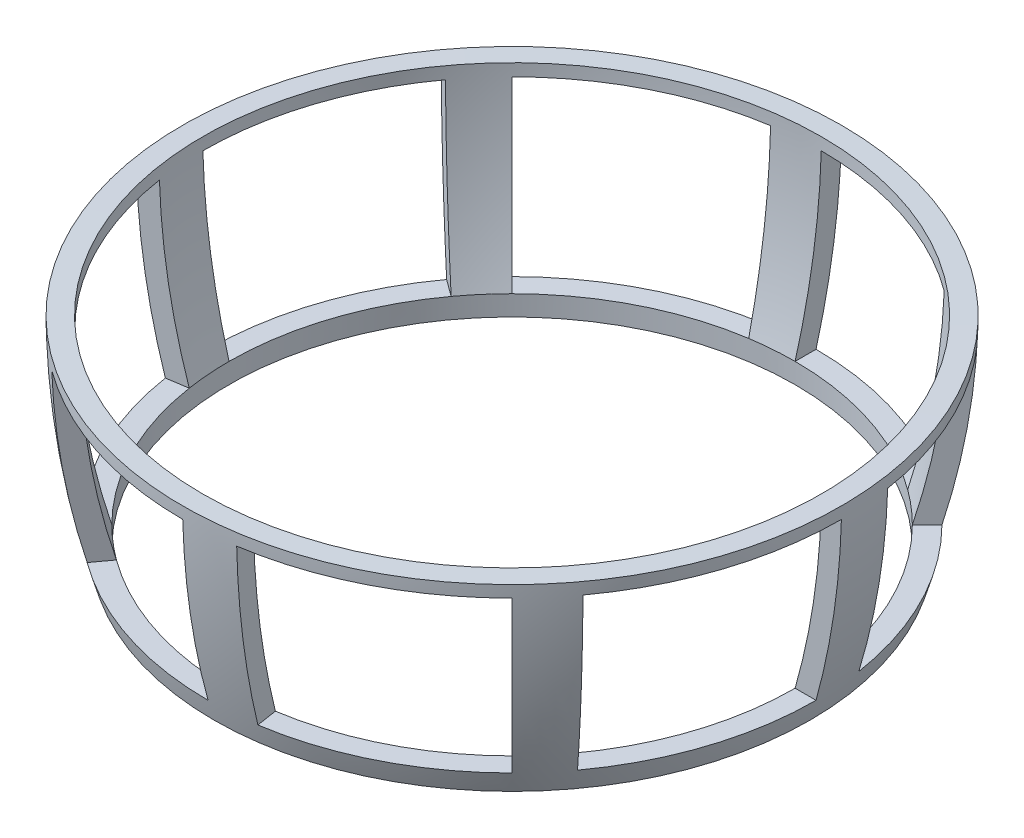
ISO-10303-21;
HEADER;
FILE_DESCRIPTION(('STEP AP214'),'2;1');
FILE_NAME('part.step','',(''),(''),'','','');
FILE_SCHEMA(('AUTOMOTIVE_DESIGN { 1 0 10303 214 1 1 1 1 }'));
ENDSEC;
DATA;
#1=APPLICATION_CONTEXT('core data for automotive mechanical design processes');
#2=APPLICATION_PROTOCOL_DEFINITION('international standard','automotive_design',2000,#1);
#3=PRODUCT_CONTEXT('',#1,'mechanical');
#4=PRODUCT('Part','Part','',(#3));
#5=PRODUCT_RELATED_PRODUCT_CATEGORY('part','',(#4));
#6=PRODUCT_DEFINITION_FORMATION('','',#4);
#7=PRODUCT_DEFINITION_CONTEXT('part definition',#1,'design');
#8=PRODUCT_DEFINITION('design','',#6,#7);
#9=PRODUCT_DEFINITION_SHAPE('','',#8);
#10=(LENGTH_UNIT() NAMED_UNIT(*) SI_UNIT(.MILLI.,.METRE.));
#11=(NAMED_UNIT(*) PLANE_ANGLE_UNIT() SI_UNIT($,.RADIAN.));
#12=(NAMED_UNIT(*) SI_UNIT($,.STERADIAN.) SOLID_ANGLE_UNIT());
#13=UNCERTAINTY_MEASURE_WITH_UNIT(LENGTH_MEASURE(1.E-05),#10,'distance_accuracy_value','');
#14=(GEOMETRIC_REPRESENTATION_CONTEXT(3) GLOBAL_UNCERTAINTY_ASSIGNED_CONTEXT((#13)) GLOBAL_UNIT_ASSIGNED_CONTEXT((#10,
#11,#12)) REPRESENTATION_CONTEXT('',''));
#15=CARTESIAN_POINT('',(0.,0.,0.));
#16=DIRECTION('',(0.,0.,1.));
#17=DIRECTION('',(1.,0.,0.));
#18=AXIS2_PLACEMENT_3D('',#15,#16,#17);
#19=CARTESIAN_POINT('',(0.,0.,0.));
#20=DIRECTION('',(0.,-1.,0.));
#21=DIRECTION('',(0.,0.,-1.));
#22=AXIS2_PLACEMENT_3D('',#19,#20,#21);
#23=PLANE('',#22);
#24=DIRECTION('',(0.,0.,-1.));
#25=VECTOR('',#24,1.);
#26=CARTESIAN_POINT('',(-9.82368815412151E-13,0.,93.7872037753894));
#27=LINE('',#26,#25);
#28=CARTESIAN_POINT('',(7.32613969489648E-13,0.,-70.2));
#29=VERTEX_POINT('',#28);
#30=CARTESIAN_POINT('',(7.7715611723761E-13,0.,-75.3937068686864));
#31=VERTEX_POINT('',#30);
#32=EDGE_CURVE('E558',#29,#31,#27,.T.);
#33=ORIENTED_EDGE('',*,*,#32,.F.);
#34=CARTESIAN_POINT('',(0.,0.,0.));
#35=DIRECTION('',(0.,1.,0.));
#36=DIRECTION('',(0.,0.,1.));
#37=AXIS2_PLACEMENT_3D('',#34,#35,#36);
#38=CIRCLE('',#37,70.2);
#39=CARTESIAN_POINT('',(41.5050402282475,0.,-56.6160015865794));
#40=VERTEX_POINT('',#39);
#41=EDGE_CURVE('E693',#40,#29,#38,.T.);
#42=ORIENTED_EDGE('',*,*,#41,.F.);
#43=DIRECTION('',(-0.591239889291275,0.,0.806495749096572));
#44=VECTOR('',#43,1.);
#45=CARTESIAN_POINT('',(0.,0.,0.));
#46=LINE('',#45,#44);
#47=CARTESIAN_POINT('',(44.575766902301,0.,-60.8047040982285));
#48=VERTEX_POINT('',#47);
#49=EDGE_CURVE('E494',#48,#40,#46,.T.);
#50=ORIENTED_EDGE('',*,*,#49,.F.);
#51=CARTESIAN_POINT('',(0.,0.,0.));
#52=DIRECTION('',(0.,1.,0.));
#53=DIRECTION('',(0.707106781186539,0.,0.707106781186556));
#54=AXIS2_PLACEMENT_3D('',#51,#52,#53);
#55=CIRCLE('',#54,75.3937068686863);
#56=EDGE_CURVE('E508',#31,#48,#55,.F.);
#57=ORIENTED_EDGE('',*,*,#56,.F.);
#58=EDGE_LOOP('',(#33,#42,#50,#57));
#59=FACE_BOUND('',#58,.T.);
#60=ADVANCED_FACE('F40',(#59),#23,.F.);
#61=DIRECTION('',(0.707106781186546,0.,-0.707106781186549));
#62=VECTOR('',#61,1.);
#63=CARTESIAN_POINT('',(0.,0.,0.));
#64=LINE('',#63,#62);
#65=CARTESIAN_POINT('',(49.6388960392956,0.,-49.6388960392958));
#66=VERTEX_POINT('',#65);
#67=CARTESIAN_POINT('',(53.3114013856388,0.,-53.311401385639));
#68=VERTEX_POINT('',#67);
#69=EDGE_CURVE('E322',#66,#68,#64,.T.);
#70=ORIENTED_EDGE('',*,*,#69,.F.);
#71=CARTESIAN_POINT('',(69.3820540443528,0.,-10.6850632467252));
#72=VERTEX_POINT('',#71);
#73=EDGE_CURVE('E685',#72,#66,#38,.T.);
#74=ORIENTED_EDGE('',*,*,#73,.F.);
#75=DIRECTION('',(-0.988348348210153,0.,0.152208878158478));
#76=VECTOR('',#75,1.);
#77=CARTESIAN_POINT('',(0.,0.,0.));
#78=LINE('',#77,#76);
#79=CARTESIAN_POINT('',(74.5152456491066,0.,-11.4755915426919));
#80=VERTEX_POINT('',#79);
#81=EDGE_CURVE('E325',#80,#72,#78,.T.);
#82=ORIENTED_EDGE('',*,*,#81,.F.);
#83=CARTESIAN_POINT('',(0.,0.,0.));
#84=DIRECTION('',(0.,1.,0.));
#85=DIRECTION('',(0.,0.,1.));
#86=AXIS2_PLACEMENT_3D('',#83,#84,#85);
#87=CIRCLE('',#86,75.3937068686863);
#88=EDGE_CURVE('E336',#68,#80,#87,.F.);
#89=ORIENTED_EDGE('',*,*,#88,.F.);
#90=EDGE_LOOP('',(#70,#74,#82,#89));
#91=FACE_BOUND('',#90,.T.);
#92=ADVANCED_FACE('F380',(#91),#23,.F.);
#93=DIRECTION('',(1.,0.,0.));
#94=VECTOR('',#93,1.);
#95=CARTESIAN_POINT('',(-93.7872037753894,0.,0.));
#96=LINE('',#95,#94);
#97=CARTESIAN_POINT('',(70.2,0.,0.));
#98=VERTEX_POINT('',#97);
#99=CARTESIAN_POINT('',(75.3937068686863,0.,0.));
#100=VERTEX_POINT('',#99);
#101=EDGE_CURVE('E12',#98,#100,#96,.T.);
#102=ORIENTED_EDGE('',*,*,#101,.F.);
#103=CARTESIAN_POINT('',(56.6160015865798,0.,41.505040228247));
#104=VERTEX_POINT('',#103);
#105=EDGE_CURVE('E499',#104,#98,#38,.T.);
#106=ORIENTED_EDGE('',*,*,#105,.F.);
#107=DIRECTION('',(-0.806495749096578,0.,-0.591239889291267));
#108=VECTOR('',#107,1.);
#109=CARTESIAN_POINT('',(0.,0.,0.));
#110=LINE('',#109,#108);
#111=CARTESIAN_POINT('',(60.804704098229,0.,44.5757669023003));
#112=VERTEX_POINT('',#111);
#113=EDGE_CURVE('E272',#112,#104,#110,.T.);
#114=ORIENTED_EDGE('',*,*,#113,.F.);
#115=CARTESIAN_POINT('',(0.,0.,0.));
#116=DIRECTION('',(0.,1.,0.));
#117=DIRECTION('',(-0.707106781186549,0.,0.707106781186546));
#118=AXIS2_PLACEMENT_3D('',#115,#116,#117);
#119=CIRCLE('',#118,75.3937068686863);
#120=EDGE_CURVE('E302',#100,#112,#119,.F.);
#121=ORIENTED_EDGE('',*,*,#120,.F.);
#122=EDGE_LOOP('',(#102,#106,#114,#121));
#123=FACE_BOUND('',#122,.T.);
#124=ADVANCED_FACE('F385',(#123),#23,.F.);
#125=DIRECTION('',(0.707106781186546,0.,0.707106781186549));
#126=VECTOR('',#125,1.);
#127=CARTESIAN_POINT('',(-66.3175677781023,0.,-66.3175677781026));
#128=LINE('',#127,#126);
#129=CARTESIAN_POINT('',(49.6388960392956,0.,49.6388960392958));
#130=VERTEX_POINT('',#129);
#131=CARTESIAN_POINT('',(53.3114013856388,0.,53.311401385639));
#132=VERTEX_POINT('',#131);
#133=EDGE_CURVE('E319',#130,#132,#128,.T.);
#134=ORIENTED_EDGE('',*,*,#133,.F.);
#135=CARTESIAN_POINT('',(10.6850632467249,0.,69.3820540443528));
#136=VERTEX_POINT('',#135);
#137=EDGE_CURVE('E262',#136,#130,#38,.T.);
#138=ORIENTED_EDGE('',*,*,#137,.F.);
#139=DIRECTION('',(-0.152208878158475,0.,-0.988348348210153));
#140=VECTOR('',#139,1.);
#141=CARTESIAN_POINT('',(0.,0.,0.));
#142=LINE('',#141,#140);
#143=CARTESIAN_POINT('',(11.4755915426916,0.,74.5152456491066));
#144=VERTEX_POINT('',#143);
#145=EDGE_CURVE('E654',#144,#136,#142,.T.);
#146=ORIENTED_EDGE('',*,*,#145,.F.);
#147=CARTESIAN_POINT('',(0.,0.,0.));
#148=DIRECTION('',(0.,1.,0.));
#149=DIRECTION('',(-1.,0.,0.));
#150=AXIS2_PLACEMENT_3D('',#147,#148,#149);
#151=CIRCLE('',#150,75.3937068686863);
#152=EDGE_CURVE('E663',#132,#144,#151,.F.);
#153=ORIENTED_EDGE('',*,*,#152,.F.);
#154=EDGE_LOOP('',(#134,#138,#146,#153));
#155=FACE_BOUND('',#154,.T.);
#156=ADVANCED_FACE('F679',(#155),#23,.F.);
#157=DIRECTION('',(0.,0.,1.));
#158=VECTOR('',#157,1.);
#159=CARTESIAN_POINT('',(3.27456271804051E-13,0.,-93.7872037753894));
#160=LINE('',#159,#158);
#161=CARTESIAN_POINT('',(-2.54590792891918E-13,0.,70.2));
#162=VERTEX_POINT('',#161);
#163=CARTESIAN_POINT('',(-2.63677968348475E-13,0.,75.3937068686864));
#164=VERTEX_POINT('',#163);
#165=EDGE_CURVE('E264',#162,#164,#160,.T.);
#166=ORIENTED_EDGE('',*,*,#165,.F.);
#167=CARTESIAN_POINT('',(-41.5050402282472,0.,56.6160015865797));
#168=VERTEX_POINT('',#167);
#169=EDGE_CURVE('E249',#168,#162,#38,.T.);
#170=ORIENTED_EDGE('',*,*,#169,.F.);
#171=DIRECTION('',(0.59123988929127,0.,-0.806495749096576));
#172=VECTOR('',#171,1.);
#173=CARTESIAN_POINT('',(0.,0.,0.));
#174=LINE('',#173,#172);
#175=CARTESIAN_POINT('',(-44.5757669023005,0.,60.8047040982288));
#176=VERTEX_POINT('',#175);
#177=EDGE_CURVE('E629',#176,#168,#174,.T.);
#178=ORIENTED_EDGE('',*,*,#177,.F.);
#179=CARTESIAN_POINT('',(0.,0.,0.));
#180=DIRECTION('',(0.,1.,0.));
#181=DIRECTION('',(-0.707106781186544,0.,-0.707106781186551));
#182=AXIS2_PLACEMENT_3D('',#179,#180,#181);
#183=CIRCLE('',#182,75.3937068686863);
#184=EDGE_CURVE('E267',#164,#176,#183,.F.);
#185=ORIENTED_EDGE('',*,*,#184,.F.);
#186=EDGE_LOOP('',(#166,#170,#178,#185));
#187=FACE_BOUND('',#186,.T.);
#188=ADVANCED_FACE('F265',(#187),#23,.F.);
#189=DIRECTION('',(-0.707106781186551,0.,0.707106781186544));
#190=VECTOR('',#189,1.);
#191=CARTESIAN_POINT('',(66.3175677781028,0.,-66.3175677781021));
#192=LINE('',#191,#190);
#193=CARTESIAN_POINT('',(-49.6388960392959,0.,49.6388960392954));
#194=VERTEX_POINT('',#193);
#195=CARTESIAN_POINT('',(-53.3114013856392,0.,53.3114013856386));
#196=VERTEX_POINT('',#195);
#197=EDGE_CURVE('E652',#194,#196,#192,.T.);
#198=ORIENTED_EDGE('',*,*,#197,.F.);
#199=CARTESIAN_POINT('',(-69.3820540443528,0.,10.6850632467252));
#200=VERTEX_POINT('',#199);
#201=EDGE_CURVE('E260',#200,#194,#38,.T.);
#202=ORIENTED_EDGE('',*,*,#201,.F.);
#203=DIRECTION('',(0.988348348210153,0.,-0.152208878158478));
#204=VECTOR('',#203,1.);
#205=CARTESIAN_POINT('',(0.,0.,0.));
#206=LINE('',#205,#204);
#207=CARTESIAN_POINT('',(-74.5152456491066,0.,11.4755915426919));
#208=VERTEX_POINT('',#207);
#209=EDGE_CURVE('E595',#208,#200,#206,.T.);
#210=ORIENTED_EDGE('',*,*,#209,.F.);
#211=CARTESIAN_POINT('',(0.,0.,0.));
#212=DIRECTION('',(0.,1.,0.));
#213=DIRECTION('',(0.,0.,-1.));
#214=AXIS2_PLACEMENT_3D('',#211,#212,#213);
#215=CIRCLE('',#214,75.3937068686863);
#216=EDGE_CURVE('E606',#196,#208,#215,.F.);
#217=ORIENTED_EDGE('',*,*,#216,.F.);
#218=EDGE_LOOP('',(#198,#202,#210,#217));
#219=FACE_BOUND('',#218,.T.);
#220=ADVANCED_FACE('F732',(#219),#23,.F.);
#221=DIRECTION('',(-1.,0.,0.));
#222=VECTOR('',#221,1.);
#223=CARTESIAN_POINT('',(93.7872037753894,0.,0.));
#224=LINE('',#223,#222);
#225=CARTESIAN_POINT('',(-70.2,0.,-5.02242691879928E-13));
#226=VERTEX_POINT('',#225);
#227=CARTESIAN_POINT('',(-75.3937068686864,0.,-5.13478148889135E-13));
#228=VERTEX_POINT('',#227);
#229=EDGE_CURVE('E626',#226,#228,#224,.T.);
#230=ORIENTED_EDGE('',*,*,#229,.F.);
#231=CARTESIAN_POINT('',(-56.6160015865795,0.,-41.5050402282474));
#232=VERTEX_POINT('',#231);
#233=EDGE_CURVE('E711',#232,#226,#38,.T.);
#234=ORIENTED_EDGE('',*,*,#233,.F.);
#235=DIRECTION('',(0.806495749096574,0.,0.591239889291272));
#236=VECTOR('',#235,1.);
#237=CARTESIAN_POINT('',(0.,0.,0.));
#238=LINE('',#237,#236);
#239=CARTESIAN_POINT('',(-60.8047040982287,0.,-44.5757669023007));
#240=VERTEX_POINT('',#239);
#241=EDGE_CURVE('E561',#240,#232,#238,.T.);
#242=ORIENTED_EDGE('',*,*,#241,.F.);
#243=CARTESIAN_POINT('',(0.,0.,0.));
#244=DIRECTION('',(0.,1.,0.));
#245=DIRECTION('',(0.707106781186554,0.,-0.707106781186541));
#246=AXIS2_PLACEMENT_3D('',#243,#244,#245);
#247=CIRCLE('',#246,75.3937068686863);
#248=EDGE_CURVE('E572',#228,#240,#247,.F.);
#249=ORIENTED_EDGE('',*,*,#248,.F.);
#250=EDGE_LOOP('',(#230,#234,#242,#249));
#251=FACE_BOUND('',#250,.T.);
#252=ADVANCED_FACE('F378',(#251),#23,.F.);
#253=CARTESIAN_POINT('',(-93.7872037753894,46.8115584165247,0.));
#254=DIRECTION('',(0.,0.,1.));
#255=DIRECTION('',(1.,0.,0.));
#256=AXIS2_PLACEMENT_3D('',#253,#254,#255);
#257=PLANE('',#256);
#258=CARTESIAN_POINT('',(-93.7872037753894,46.8115584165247,0.));
#259=DIRECTION('',(0.,0.,1.));
#260=DIRECTION('',(1.,0.,0.));
#261=AXIS2_PLACEMENT_3D('',#258,#259,#260);
#262=CIRCLE('',#261,170.537752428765);
#263=CARTESIAN_POINT('',(76.6826583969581,42.,0.));
#264=VERTEX_POINT('',#263);
#265=EDGE_CURVE('E349',#98,#264,#262,.T.);
#266=ORIENTED_EDGE('',*,*,#265,.F.);
#267=ORIENTED_EDGE('',*,*,#101,.T.);
#268=CARTESIAN_POINT('',(-93.7872037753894,46.8115584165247,0.));
#269=DIRECTION('',(0.,0.,1.));
#270=DIRECTION('',(1.,0.,0.));
#271=AXIS2_PLACEMENT_3D('',#268,#269,#270);
#272=CIRCLE('',#271,175.537752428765);
#273=CARTESIAN_POINT('',(81.6845929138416,42.,0.));
#274=VERTEX_POINT('',#273);
#275=EDGE_CURVE('E347',#100,#274,#272,.T.);
#276=ORIENTED_EDGE('',*,*,#275,.T.);
#277=DIRECTION('',(-1.,0.,0.));
#278=VECTOR('',#277,1.);
#279=CARTESIAN_POINT('',(-93.7872037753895,42.,0.));
#280=LINE('',#279,#278);
#281=EDGE_CURVE('E305',#274,#264,#280,.T.);
#282=ORIENTED_EDGE('',*,*,#281,.T.);
#283=EDGE_LOOP('',(#266,#267,#276,#282));
#284=FACE_BOUND('',#283,.T.);
#285=ADVANCED_FACE('F395',(#284),#257,.T.);
#286=CARTESIAN_POINT('',(0.,46.8115584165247,0.));
#287=DIRECTION('',(0.,-1.,0.));
#288=DIRECTION('',(0.,0.,-1.));
#289=AXIS2_PLACEMENT_3D('',#286,#287,#288);
#290=DEGENERATE_TOROIDAL_SURFACE('',#289,93.7872037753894,175.537752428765,.F.);
#291=CARTESIAN_POINT('',(-66.3175677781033,46.8115584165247,66.3175677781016));
#292=DIRECTION('',(0.707106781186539,0.,0.707106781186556));
#293=DIRECTION('',(0.707106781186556,0.,-0.707106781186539));
#294=AXIS2_PLACEMENT_3D('',#291,#292,#293);
#295=CIRCLE('',#294,175.537752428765);
#296=CARTESIAN_POINT('',(57.7597295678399,42.,-57.7597295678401));
#297=VERTEX_POINT('',#296);
#298=EDGE_CURVE('E519',#68,#297,#295,.T.);
#299=ORIENTED_EDGE('',*,*,#298,.F.);
#300=ORIENTED_EDGE('',*,*,#88,.T.);
#301=CARTESIAN_POINT('',(-92.6944279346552,46.8115584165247,14.2752450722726));
#302=DIRECTION('',(0.152208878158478,0.,0.988348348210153));
#303=DIRECTION('',(0.988348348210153,0.,-0.152208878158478));
#304=AXIS2_PLACEMENT_3D('',#301,#302,#303);
#305=CIRCLE('',#304,175.537752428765);
#306=CARTESIAN_POINT('',(80.732832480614,42.,-12.4331202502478));
#307=VERTEX_POINT('',#306);
#308=EDGE_CURVE('E334',#307,#80,#305,.F.);
#309=ORIENTED_EDGE('',*,*,#308,.F.);
#310=CARTESIAN_POINT('',(0.,42.,0.));
#311=DIRECTION('',(0.,1.,0.));
#312=DIRECTION('',(0.,0.,1.));
#313=AXIS2_PLACEMENT_3D('',#310,#311,#312);
#314=CIRCLE('',#313,81.6845929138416);
#315=EDGE_CURVE('E345',#297,#307,#314,.F.);
#316=ORIENTED_EDGE('',*,*,#315,.F.);
#317=EDGE_LOOP('',(#299,#300,#309,#316));
#318=FACE_BOUND('',#317,.T.);
#319=CARTESIAN_POINT('',(0.,44.9468868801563,0.));
#320=DIRECTION('',(0.,-1.,0.));
#321=DIRECTION('',(0.,0.,-1.));
#322=AXIS2_PLACEMENT_3D('',#319,#320,#321);
#323=CIRCLE('',#322,81.7406445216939);
#324=CARTESIAN_POINT('',(0.,44.9468868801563,-81.7406445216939));
#325=VERTEX_POINT('',#324);
#326=EDGE_CURVE('E48',#325,#325,#323,.T.);
#327=ORIENTED_EDGE('',*,*,#326,.T.);
#328=EDGE_LOOP('',(#327));
#329=FACE_BOUND('',#328,.T.);
#330=ORIENTED_EDGE('',*,*,#275,.F.);
#331=ORIENTED_EDGE('',*,*,#120,.T.);
#332=CARTESIAN_POINT('',(-75.6389811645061,46.8115584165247,-55.4507359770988));
#333=DIRECTION('',(-0.591239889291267,0.,0.806495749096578));
#334=DIRECTION('',(0.806495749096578,0.,0.591239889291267));
#335=AXIS2_PLACEMENT_3D('',#332,#333,#334);
#336=CIRCLE('',#335,175.537752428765);
#337=CARTESIAN_POINT('',(65.8782769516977,42.,48.2951896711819));
#338=VERTEX_POINT('',#337);
#339=EDGE_CURVE('E300',#338,#112,#336,.F.);
#340=ORIENTED_EDGE('',*,*,#339,.F.);
#341=CARTESIAN_POINT('',(0.,42.,0.));
#342=DIRECTION('',(0.,1.,0.));
#343=DIRECTION('',(-0.707106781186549,0.,0.707106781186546));
#344=AXIS2_PLACEMENT_3D('',#341,#342,#343);
#345=CIRCLE('',#344,81.6845929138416);
#346=EDGE_CURVE('E308',#274,#338,#345,.F.);
#347=ORIENTED_EDGE('',*,*,#346,.F.);
#348=EDGE_LOOP('',(#330,#331,#340,#347));
#349=FACE_BOUND('',#348,.T.);
#350=CARTESIAN_POINT('',(0.,-5.,0.));
#351=DIRECTION('',(0.,-1.,0.));
#352=DIRECTION('',(0.,0.,-1.));
#353=AXIS2_PLACEMENT_3D('',#350,#351,#352);
#354=CIRCLE('',#353,73.9300134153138);
#355=CARTESIAN_POINT('',(0.,-5.,-73.9300134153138));
#356=VERTEX_POINT('',#355);
#357=EDGE_CURVE('E352',#356,#356,#354,.T.);
#358=ORIENTED_EDGE('',*,*,#357,.F.);
#359=EDGE_LOOP('',(#358));
#360=FACE_BOUND('',#359,.T.);
#361=CARTESIAN_POINT('',(-66.3175677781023,46.8115584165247,-66.3175677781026));
#362=DIRECTION('',(-0.707106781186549,0.,0.707106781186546));
#363=DIRECTION('',(0.707106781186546,0.,0.707106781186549));
#364=AXIS2_PLACEMENT_3D('',#361,#362,#363);
#365=CIRCLE('',#364,175.537752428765);
#366=CARTESIAN_POINT('',(57.7597295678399,42.,57.7597295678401));
#367=VERTEX_POINT('',#366);
#368=EDGE_CURVE('E310',#132,#367,#365,.T.);
#369=ORIENTED_EDGE('',*,*,#368,.F.);
#370=ORIENTED_EDGE('',*,*,#152,.T.);
#371=CARTESIAN_POINT('',(-14.2752450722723,46.8115584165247,-92.6944279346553));
#372=DIRECTION('',(-0.988348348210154,0.,0.152208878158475));
#373=DIRECTION('',(0.152208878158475,0.,0.988348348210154));
#374=AXIS2_PLACEMENT_3D('',#371,#372,#373);
#375=CIRCLE('',#374,175.537752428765);
#376=CARTESIAN_POINT('',(12.4331202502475,42.,80.7328324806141));
#377=VERTEX_POINT('',#376);
#378=EDGE_CURVE('E661',#377,#144,#375,.F.);
#379=ORIENTED_EDGE('',*,*,#378,.F.);
#380=CARTESIAN_POINT('',(0.,42.,0.));
#381=DIRECTION('',(0.,1.,0.));
#382=DIRECTION('',(-1.,0.,0.));
#383=AXIS2_PLACEMENT_3D('',#380,#381,#382);
#384=CIRCLE('',#383,81.6845929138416);
#385=EDGE_CURVE('E289',#367,#377,#384,.F.);
#386=ORIENTED_EDGE('',*,*,#385,.F.);
#387=EDGE_LOOP('',(#369,#370,#379,#386));
#388=FACE_BOUND('',#387,.T.);
#389=CARTESIAN_POINT('',(3.27456271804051E-13,46.8115584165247,-93.7872037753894));
#390=DIRECTION('',(-1.,0.,0.));
#391=DIRECTION('',(0.,0.,1.));
#392=AXIS2_PLACEMENT_3D('',#389,#390,#391);
#393=CIRCLE('',#392,175.537752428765);
#394=CARTESIAN_POINT('',(-2.84494650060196E-13,42.,81.6845929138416));
#395=VERTEX_POINT('',#394);
#396=EDGE_CURVE('E287',#164,#395,#393,.T.);
#397=ORIENTED_EDGE('',*,*,#396,.F.);
#398=ORIENTED_EDGE('',*,*,#184,.T.);
#399=CARTESIAN_POINT('',(55.450735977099,46.8115584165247,-75.6389811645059));
#400=DIRECTION('',(-0.806495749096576,0.,-0.59123988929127));
#401=DIRECTION('',(-0.59123988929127,0.,0.806495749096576));
#402=AXIS2_PLACEMENT_3D('',#399,#400,#401);
#403=CIRCLE('',#402,175.537752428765);
#404=CARTESIAN_POINT('',(-48.2951896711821,42.,65.8782769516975));
#405=VERTEX_POINT('',#404);
#406=EDGE_CURVE('E637',#405,#176,#403,.F.);
#407=ORIENTED_EDGE('',*,*,#406,.F.);
#408=CARTESIAN_POINT('',(0.,42.,0.));
#409=DIRECTION('',(0.,1.,0.));
#410=DIRECTION('',(-0.707106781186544,0.,-0.707106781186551));
#411=AXIS2_PLACEMENT_3D('',#408,#409,#410);
#412=CIRCLE('',#411,81.6845929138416);
#413=EDGE_CURVE('E643',#395,#405,#412,.F.);
#414=ORIENTED_EDGE('',*,*,#413,.F.);
#415=EDGE_LOOP('',(#397,#398,#407,#414));
#416=FACE_BOUND('',#415,.T.);
#417=CARTESIAN_POINT('',(66.3175677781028,46.8115584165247,-66.3175677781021));
#418=DIRECTION('',(-0.707106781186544,0.,-0.707106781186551));
#419=DIRECTION('',(-0.707106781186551,0.,0.707106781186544));
#420=AXIS2_PLACEMENT_3D('',#417,#418,#419);
#421=CIRCLE('',#420,175.537752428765);
#422=CARTESIAN_POINT('',(-57.7597295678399,42.,57.7597295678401));
#423=VERTEX_POINT('',#422);
#424=EDGE_CURVE('E645',#196,#423,#421,.T.);
#425=ORIENTED_EDGE('',*,*,#424,.F.);
#426=ORIENTED_EDGE('',*,*,#216,.T.);
#427=CARTESIAN_POINT('',(92.6944279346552,46.8115584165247,-14.2752450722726));
#428=DIRECTION('',(-0.152208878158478,0.,-0.988348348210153));
#429=DIRECTION('',(-0.988348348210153,0.,0.152208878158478));
#430=AXIS2_PLACEMENT_3D('',#427,#428,#429);
#431=CIRCLE('',#430,175.537752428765);
#432=CARTESIAN_POINT('',(-80.732832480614,42.,12.4331202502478));
#433=VERTEX_POINT('',#432);
#434=EDGE_CURVE('E604',#433,#208,#431,.F.);
#435=ORIENTED_EDGE('',*,*,#434,.F.);
#436=CARTESIAN_POINT('',(0.,42.,0.));
#437=DIRECTION('',(0.,1.,0.));
#438=DIRECTION('',(0.,0.,-1.));
#439=AXIS2_PLACEMENT_3D('',#436,#437,#438);
#440=CIRCLE('',#439,81.6845929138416);
#441=EDGE_CURVE('E615',#423,#433,#440,.F.);
#442=ORIENTED_EDGE('',*,*,#441,.F.);
#443=EDGE_LOOP('',(#425,#426,#435,#442));
#444=FACE_BOUND('',#443,.T.);
#445=CARTESIAN_POINT('',(93.7872037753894,46.8115584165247,0.));
#446=DIRECTION('',(0.,0.,-1.));
#447=DIRECTION('',(-1.,0.,0.));
#448=AXIS2_PLACEMENT_3D('',#445,#446,#447);
#449=CIRCLE('',#448,175.537752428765);
#450=CARTESIAN_POINT('',(-81.6845929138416,42.,-5.62050406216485E-13));
#451=VERTEX_POINT('',#450);
#452=EDGE_CURVE('E617',#228,#451,#449,.T.);
#453=ORIENTED_EDGE('',*,*,#452,.F.);
#454=ORIENTED_EDGE('',*,*,#248,.T.);
#455=CARTESIAN_POINT('',(75.6389811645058,46.8115584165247,55.4507359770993));
#456=DIRECTION('',(0.591239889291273,0.,-0.806495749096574));
#457=DIRECTION('',(-0.806495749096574,0.,-0.591239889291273));
#458=AXIS2_PLACEMENT_3D('',#455,#456,#457);
#459=CIRCLE('',#458,175.537752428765);
#460=CARTESIAN_POINT('',(-65.8782769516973,42.,-48.2951896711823));
#461=VERTEX_POINT('',#460);
#462=EDGE_CURVE('E570',#461,#240,#459,.F.);
#463=ORIENTED_EDGE('',*,*,#462,.F.);
#464=CARTESIAN_POINT('',(0.,42.,0.));
#465=DIRECTION('',(0.,1.,0.));
#466=DIRECTION('',(0.707106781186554,0.,-0.707106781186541));
#467=AXIS2_PLACEMENT_3D('',#464,#465,#466);
#468=CIRCLE('',#467,81.6845929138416);
#469=EDGE_CURVE('E581',#451,#461,#468,.F.);
#470=ORIENTED_EDGE('',*,*,#469,.F.);
#471=EDGE_LOOP('',(#453,#454,#463,#470));
#472=FACE_BOUND('',#471,.T.);
#473=CARTESIAN_POINT('',(66.3175677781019,46.8115584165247,66.317567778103));
#474=DIRECTION('',(0.707106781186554,0.,-0.707106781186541));
#475=DIRECTION('',(-0.707106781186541,0.,-0.707106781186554));
#476=AXIS2_PLACEMENT_3D('',#473,#474,#475);
#477=CIRCLE('',#476,175.537752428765);
#478=CARTESIAN_POINT('',(-53.3114013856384,0.,-53.3114013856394));
#479=VERTEX_POINT('',#478);
#480=CARTESIAN_POINT('',(-57.7597295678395,42.,-57.7597295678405));
#481=VERTEX_POINT('',#480);
#482=EDGE_CURVE('E583',#479,#481,#477,.T.);
#483=ORIENTED_EDGE('',*,*,#482,.F.);
#484=CARTESIAN_POINT('',(0.,0.,0.));
#485=DIRECTION('',(0.,1.,0.));
#486=DIRECTION('',(1.,0.,0.));
#487=AXIS2_PLACEMENT_3D('',#484,#485,#486);
#488=CIRCLE('',#487,75.3937068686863);
#489=CARTESIAN_POINT('',(-11.4755915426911,0.,-74.5152456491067));
#490=VERTEX_POINT('',#489);
#491=EDGE_CURVE('E538',#479,#490,#488,.F.);
#492=ORIENTED_EDGE('',*,*,#491,.T.);
#493=CARTESIAN_POINT('',(14.2752450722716,46.8115584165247,92.6944279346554));
#494=DIRECTION('',(0.988348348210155,0.,-0.152208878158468));
#495=DIRECTION('',(-0.152208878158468,0.,-0.988348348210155));
#496=AXIS2_PLACEMENT_3D('',#493,#494,#495);
#497=CIRCLE('',#496,175.537752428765);
#498=CARTESIAN_POINT('',(-12.4331202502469,42.,-80.7328324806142));
#499=VERTEX_POINT('',#498);
#500=EDGE_CURVE('E536',#499,#490,#497,.F.);
#501=ORIENTED_EDGE('',*,*,#500,.F.);
#502=CARTESIAN_POINT('',(0.,42.,0.));
#503=DIRECTION('',(0.,1.,0.));
#504=DIRECTION('',(1.,0.,0.));
#505=AXIS2_PLACEMENT_3D('',#502,#503,#504);
#506=CIRCLE('',#505,81.6845929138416);
#507=EDGE_CURVE('E547',#481,#499,#506,.F.);
#508=ORIENTED_EDGE('',*,*,#507,.F.);
#509=EDGE_LOOP('',(#483,#492,#501,#508));
#510=FACE_BOUND('',#509,.T.);
#511=CARTESIAN_POINT('',(-9.82368815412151E-13,46.8115584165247,93.7872037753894));
#512=DIRECTION('',(1.,0.,0.));
#513=DIRECTION('',(0.,0.,-1.));
#514=AXIS2_PLACEMENT_3D('',#511,#512,#513);
#515=CIRCLE('',#514,175.537752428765);
#516=CARTESIAN_POINT('',(8.46545056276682E-13,42.,-81.6845929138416));
#517=VERTEX_POINT('',#516);
#518=EDGE_CURVE('E549',#31,#517,#515,.T.);
#519=ORIENTED_EDGE('',*,*,#518,.F.);
#520=ORIENTED_EDGE('',*,*,#56,.T.);
#521=CARTESIAN_POINT('',(-55.4507359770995,46.8115584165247,75.6389811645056));
#522=DIRECTION('',(0.806495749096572,0.,0.591239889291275));
#523=DIRECTION('',(0.591239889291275,0.,-0.806495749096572));
#524=AXIS2_PLACEMENT_3D('',#521,#522,#523);
#525=CIRCLE('',#524,175.537752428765);
#526=CARTESIAN_POINT('',(48.2951896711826,42.,-65.8782769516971));
#527=VERTEX_POINT('',#526);
#528=EDGE_CURVE('E506',#527,#48,#525,.F.);
#529=ORIENTED_EDGE('',*,*,#528,.F.);
#530=CARTESIAN_POINT('',(0.,42.,0.));
#531=DIRECTION('',(0.,1.,0.));
#532=DIRECTION('',(0.707106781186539,0.,0.707106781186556));
#533=AXIS2_PLACEMENT_3D('',#530,#531,#532);
#534=CIRCLE('',#533,81.6845929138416);
#535=EDGE_CURVE('E517',#517,#527,#534,.F.);
#536=ORIENTED_EDGE('',*,*,#535,.F.);
#537=EDGE_LOOP('',(#519,#520,#529,#536));
#538=FACE_BOUND('',#537,.T.);
#539=ADVANCED_FACE('F363',(#318,#329,#349,#360,#388,#416,#444,#472,#510,#538),#290,.F.);
#540=CARTESIAN_POINT('',(0.,45.,0.));
#541=DIRECTION('',(0.,-1.,0.));
#542=DIRECTION('',(0.,0.,-1.));
#543=AXIS2_PLACEMENT_3D('',#540,#541,#542);
#544=CONICAL_SURFACE('',#543,76.7409266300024,1.56017350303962);
#545=ORIENTED_EDGE('',*,*,#326,.F.);
#546=EDGE_LOOP('',(#545));
#547=FACE_BOUND('',#546,.T.);
#548=CARTESIAN_POINT('',(0.,45.,0.));
#549=DIRECTION('',(0.,-1.,0.));
#550=DIRECTION('',(0.,0.,-1.));
#551=AXIS2_PLACEMENT_3D('',#548,#549,#550);
#552=CIRCLE('',#551,76.7409266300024);
#553=CARTESIAN_POINT('',(0.,45.,-76.7409266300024));
#554=VERTEX_POINT('',#553);
#555=EDGE_CURVE('E358',#554,#554,#552,.T.);
#556=ORIENTED_EDGE('',*,*,#555,.T.);
#557=EDGE_LOOP('',(#556));
#558=FACE_BOUND('',#557,.T.);
#559=ADVANCED_FACE('F42',(#547,#558),#544,.T.);
#560=CARTESIAN_POINT('',(0.,46.8115584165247,0.));
#561=DIRECTION('',(0.,-1.,0.));
#562=DIRECTION('',(0.,0.,-1.));
#563=AXIS2_PLACEMENT_3D('',#560,#561,#562);
#564=DEGENERATE_TOROIDAL_SURFACE('',#563,93.7872037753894,170.537752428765,.F.);
#565=ORIENTED_EDGE('',*,*,#555,.F.);
#566=EDGE_LOOP('',(#565));
#567=FACE_BOUND('',#566,.T.);
#568=CARTESIAN_POINT('',(-66.3175677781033,46.8115584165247,66.3175677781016));
#569=DIRECTION('',(0.707106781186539,0.,0.707106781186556));
#570=DIRECTION('',(0.707106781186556,0.,-0.707106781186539));
#571=AXIS2_PLACEMENT_3D('',#568,#569,#570);
#572=CIRCLE('',#571,170.537752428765);
#573=CARTESIAN_POINT('',(54.2228277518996,42.,-54.2228277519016));
#574=VERTEX_POINT('',#573);
#575=EDGE_CURVE('E522',#66,#574,#572,.T.);
#576=ORIENTED_EDGE('',*,*,#575,.T.);
#577=CARTESIAN_POINT('',(0.,42.,0.));
#578=DIRECTION('',(0.,1.,0.));
#579=DIRECTION('',(0.,0.,1.));
#580=AXIS2_PLACEMENT_3D('',#577,#578,#579);
#581=CIRCLE('',#580,76.6826583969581);
#582=CARTESIAN_POINT('',(75.7891787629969,42.,-11.6717814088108));
#583=VERTEX_POINT('',#582);
#584=EDGE_CURVE('E342',#574,#583,#581,.F.);
#585=ORIENTED_EDGE('',*,*,#584,.T.);
#586=CARTESIAN_POINT('',(-92.6944279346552,46.8115584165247,14.2752450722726));
#587=DIRECTION('',(0.152208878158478,0.,0.988348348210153));
#588=DIRECTION('',(0.988348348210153,0.,-0.152208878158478));
#589=AXIS2_PLACEMENT_3D('',#586,#587,#588);
#590=CIRCLE('',#589,170.537752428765);
#591=EDGE_CURVE('E329',#583,#72,#590,.F.);
#592=ORIENTED_EDGE('',*,*,#591,.T.);
#593=CARTESIAN_POINT('',(0.,0.,0.));
#594=DIRECTION('',(0.,-1.,0.));
#595=DIRECTION('',(0.,0.,-1.));
#596=AXIS2_PLACEMENT_3D('',#593,#594,#595);
#597=CIRCLE('',#596,70.2);
#598=EDGE_CURVE('E355',#72,#98,#597,.T.);
#599=ORIENTED_EDGE('',*,*,#598,.T.);
#600=ORIENTED_EDGE('',*,*,#265,.T.);
#601=CARTESIAN_POINT('',(0.,42.,0.));
#602=DIRECTION('',(0.,1.,0.));
#603=DIRECTION('',(-0.707106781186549,0.,0.707106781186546));
#604=AXIS2_PLACEMENT_3D('',#601,#602,#603);
#605=CIRCLE('',#604,76.6826583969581);
#606=CARTESIAN_POINT('',(61.8442380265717,42.,45.3378464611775));
#607=VERTEX_POINT('',#606);
#608=EDGE_CURVE('E61',#264,#607,#605,.F.);
#609=ORIENTED_EDGE('',*,*,#608,.T.);
#610=CARTESIAN_POINT('',(-75.6389811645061,46.8115584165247,-55.4507359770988));
#611=DIRECTION('',(-0.591239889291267,0.,0.806495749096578));
#612=DIRECTION('',(0.806495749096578,0.,0.591239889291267));
#613=AXIS2_PLACEMENT_3D('',#610,#611,#612);
#614=CIRCLE('',#613,170.537752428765);
#615=EDGE_CURVE('E295',#607,#104,#614,.F.);
#616=ORIENTED_EDGE('',*,*,#615,.T.);
#617=CARTESIAN_POINT('',(0.,0.,0.));
#618=DIRECTION('',(0.,-1.,0.));
#619=DIRECTION('',(0.707106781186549,0.,-0.707106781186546));
#620=AXIS2_PLACEMENT_3D('',#617,#618,#619);
#621=CIRCLE('',#620,70.2);
#622=EDGE_CURVE('E316',#104,#130,#621,.T.);
#623=ORIENTED_EDGE('',*,*,#622,.T.);
#624=CARTESIAN_POINT('',(-66.3175677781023,46.8115584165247,-66.3175677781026));
#625=DIRECTION('',(-0.707106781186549,0.,0.707106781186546));
#626=DIRECTION('',(0.707106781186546,0.,0.707106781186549));
#627=AXIS2_PLACEMENT_3D('',#624,#625,#626);
#628=CIRCLE('',#627,170.537752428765);
#629=CARTESIAN_POINT('',(54.2228277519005,42.,54.2228277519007));
#630=VERTEX_POINT('',#629);
#631=EDGE_CURVE('E313',#130,#630,#628,.T.);
#632=ORIENTED_EDGE('',*,*,#631,.T.);
#633=CARTESIAN_POINT('',(0.,42.,0.));
#634=DIRECTION('',(0.,1.,0.));
#635=DIRECTION('',(-1.,0.,0.));
#636=AXIS2_PLACEMENT_3D('',#633,#634,#635);
#637=CIRCLE('',#636,76.6826583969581);
#638=CARTESIAN_POINT('',(11.6717814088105,42.,75.789178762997));
#639=VERTEX_POINT('',#638);
#640=EDGE_CURVE('E669',#630,#639,#637,.F.);
#641=ORIENTED_EDGE('',*,*,#640,.T.);
#642=CARTESIAN_POINT('',(-14.2752450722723,46.8115584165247,-92.6944279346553));
#643=DIRECTION('',(-0.988348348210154,0.,0.152208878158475));
#644=DIRECTION('',(0.152208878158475,0.,0.988348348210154));
#645=AXIS2_PLACEMENT_3D('',#642,#643,#644);
#646=CIRCLE('',#645,170.537752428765);
#647=EDGE_CURVE('E282',#639,#136,#646,.F.);
#648=ORIENTED_EDGE('',*,*,#647,.T.);
#649=CARTESIAN_POINT('',(0.,0.,0.));
#650=DIRECTION('',(0.,-1.,0.));
#651=DIRECTION('',(1.,0.,0.));
#652=AXIS2_PLACEMENT_3D('',#649,#650,#651);
#653=CIRCLE('',#652,70.2);
#654=EDGE_CURVE('E253',#136,#162,#653,.T.);
#655=ORIENTED_EDGE('',*,*,#654,.T.);
#656=CARTESIAN_POINT('',(3.27456271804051E-13,46.8115584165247,-93.7872037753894));
#657=DIRECTION('',(-1.,0.,0.));
#658=DIRECTION('',(0.,0.,1.));
#659=AXIS2_PLACEMENT_3D('',#656,#657,#658);
#660=CIRCLE('',#659,170.537752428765);
#661=CARTESIAN_POINT('',(-2.67736070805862E-13,42.,76.6826583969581));
#662=VERTEX_POINT('',#661);
#663=EDGE_CURVE('E280',#162,#662,#660,.T.);
#664=ORIENTED_EDGE('',*,*,#663,.T.);
#665=CARTESIAN_POINT('',(0.,42.,0.));
#666=DIRECTION('',(0.,1.,0.));
#667=DIRECTION('',(-0.707106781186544,0.,-0.707106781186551));
#668=AXIS2_PLACEMENT_3D('',#665,#666,#667);
#669=CIRCLE('',#668,76.6826583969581);
#670=CARTESIAN_POINT('',(-45.3378464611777,42.,61.8442380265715));
#671=VERTEX_POINT('',#670);
#672=EDGE_CURVE('E641',#662,#671,#669,.F.);
#673=ORIENTED_EDGE('',*,*,#672,.T.);
#674=CARTESIAN_POINT('',(55.450735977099,46.8115584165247,-75.6389811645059));
#675=DIRECTION('',(-0.806495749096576,0.,-0.59123988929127));
#676=DIRECTION('',(-0.59123988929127,0.,0.806495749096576));
#677=AXIS2_PLACEMENT_3D('',#674,#675,#676);
#678=CIRCLE('',#677,170.537752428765);
#679=EDGE_CURVE('E633',#671,#168,#678,.F.);
#680=ORIENTED_EDGE('',*,*,#679,.T.);
#681=CARTESIAN_POINT('',(0.,0.,0.));
#682=DIRECTION('',(0.,-1.,0.));
#683=DIRECTION('',(0.707106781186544,0.,0.707106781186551));
#684=AXIS2_PLACEMENT_3D('',#681,#682,#683);
#685=CIRCLE('',#684,70.2);
#686=EDGE_CURVE('E256',#168,#194,#685,.T.);
#687=ORIENTED_EDGE('',*,*,#686,.T.);
#688=CARTESIAN_POINT('',(66.3175677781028,46.8115584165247,-66.3175677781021));
#689=DIRECTION('',(-0.707106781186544,0.,-0.707106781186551));
#690=DIRECTION('',(-0.707106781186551,0.,0.707106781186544));
#691=AXIS2_PLACEMENT_3D('',#688,#689,#690);
#692=CIRCLE('',#691,170.537752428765);
#693=CARTESIAN_POINT('',(-54.2228277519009,42.,54.2228277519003));
#694=VERTEX_POINT('',#693);
#695=EDGE_CURVE('E648',#194,#694,#692,.T.);
#696=ORIENTED_EDGE('',*,*,#695,.T.);
#697=CARTESIAN_POINT('',(0.,42.,0.));
#698=DIRECTION('',(0.,1.,0.));
#699=DIRECTION('',(0.,0.,-1.));
#700=AXIS2_PLACEMENT_3D('',#697,#698,#699);
#701=CIRCLE('',#700,76.6826583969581);
#702=CARTESIAN_POINT('',(-75.7891787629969,42.,11.6717814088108));
#703=VERTEX_POINT('',#702);
#704=EDGE_CURVE('E612',#694,#703,#701,.F.);
#705=ORIENTED_EDGE('',*,*,#704,.T.);
#706=CARTESIAN_POINT('',(92.6944279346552,46.8115584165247,-14.2752450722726));
#707=DIRECTION('',(-0.152208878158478,0.,-0.988348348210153));
#708=DIRECTION('',(-0.988348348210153,0.,0.152208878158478));
#709=AXIS2_PLACEMENT_3D('',#706,#707,#708);
#710=CIRCLE('',#709,170.537752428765);
#711=EDGE_CURVE('E599',#703,#200,#710,.F.);
#712=ORIENTED_EDGE('',*,*,#711,.T.);
#713=CARTESIAN_POINT('',(0.,0.,0.));
#714=DIRECTION('',(0.,-1.,0.));
#715=DIRECTION('',(0.,0.,1.));
#716=AXIS2_PLACEMENT_3D('',#713,#714,#715);
#717=CIRCLE('',#716,70.2);
#718=EDGE_CURVE('E623',#200,#226,#717,.T.);
#719=ORIENTED_EDGE('',*,*,#718,.T.);
#720=CARTESIAN_POINT('',(93.7872037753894,46.8115584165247,0.));
#721=DIRECTION('',(0.,0.,-1.));
#722=DIRECTION('',(-1.,0.,0.));
#723=AXIS2_PLACEMENT_3D('',#720,#721,#722);
#724=CIRCLE('',#723,170.537752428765);
#725=CARTESIAN_POINT('',(-76.6826583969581,42.,0.));
#726=VERTEX_POINT('',#725);
#727=EDGE_CURVE('E620',#226,#726,#724,.T.);
#728=ORIENTED_EDGE('',*,*,#727,.T.);
#729=CARTESIAN_POINT('',(0.,42.,0.));
#730=DIRECTION('',(0.,1.,0.));
#731=DIRECTION('',(0.707106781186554,0.,-0.707106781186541));
#732=AXIS2_PLACEMENT_3D('',#729,#730,#731);
#733=CIRCLE('',#732,76.6826583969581);
#734=CARTESIAN_POINT('',(-61.8442380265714,42.,-45.337846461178));
#735=VERTEX_POINT('',#734);
#736=EDGE_CURVE('E578',#726,#735,#733,.F.);
#737=ORIENTED_EDGE('',*,*,#736,.T.);
#738=CARTESIAN_POINT('',(75.6389811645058,46.8115584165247,55.4507359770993));
#739=DIRECTION('',(0.591239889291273,0.,-0.806495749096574));
#740=DIRECTION('',(-0.806495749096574,0.,-0.591239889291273));
#741=AXIS2_PLACEMENT_3D('',#738,#739,#740);
#742=CIRCLE('',#741,170.537752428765);
#743=EDGE_CURVE('E565',#735,#232,#742,.F.);
#744=ORIENTED_EDGE('',*,*,#743,.T.);
#745=CARTESIAN_POINT('',(0.,0.,0.));
#746=DIRECTION('',(0.,-1.,0.));
#747=DIRECTION('',(-0.707106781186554,0.,0.707106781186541));
#748=AXIS2_PLACEMENT_3D('',#745,#746,#747);
#749=CIRCLE('',#748,70.2);
#750=CARTESIAN_POINT('',(-49.6388960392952,0.,-49.6388960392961));
#751=VERTEX_POINT('',#750);
#752=EDGE_CURVE('E589',#232,#751,#749,.T.);
#753=ORIENTED_EDGE('',*,*,#752,.T.);
#754=CARTESIAN_POINT('',(66.3175677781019,46.8115584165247,66.317567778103));
#755=DIRECTION('',(0.707106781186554,0.,-0.707106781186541));
#756=DIRECTION('',(-0.707106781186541,0.,-0.707106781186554));
#757=AXIS2_PLACEMENT_3D('',#754,#755,#756);
#758=CIRCLE('',#757,170.537752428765);
#759=CARTESIAN_POINT('',(-54.2228277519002,42.,-54.2228277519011));
#760=VERTEX_POINT('',#759);
#761=EDGE_CURVE('E586',#751,#760,#758,.T.);
#762=ORIENTED_EDGE('',*,*,#761,.T.);
#763=CARTESIAN_POINT('',(0.,42.,0.));
#764=DIRECTION('',(0.,1.,0.));
#765=DIRECTION('',(1.,0.,0.));
#766=AXIS2_PLACEMENT_3D('',#763,#764,#765);
#767=CIRCLE('',#766,76.6826583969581);
#768=CARTESIAN_POINT('',(-11.67178140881,42.,-75.789178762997));
#769=VERTEX_POINT('',#768);
#770=EDGE_CURVE('E544',#760,#769,#767,.F.);
#771=ORIENTED_EDGE('',*,*,#770,.T.);
#772=CARTESIAN_POINT('',(14.2752450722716,46.8115584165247,92.6944279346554));
#773=DIRECTION('',(0.988348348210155,0.,-0.152208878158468));
#774=DIRECTION('',(-0.152208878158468,0.,-0.988348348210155));
#775=AXIS2_PLACEMENT_3D('',#772,#773,#774);
#776=CIRCLE('',#775,170.537752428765);
#777=CARTESIAN_POINT('',(-10.6850632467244,0.,-69.3820540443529));
#778=VERTEX_POINT('',#777);
#779=EDGE_CURVE('E531',#769,#778,#776,.F.);
#780=ORIENTED_EDGE('',*,*,#779,.T.);
#781=CARTESIAN_POINT('',(0.,0.,0.));
#782=DIRECTION('',(0.,-1.,0.));
#783=DIRECTION('',(-1.,0.,0.));
#784=AXIS2_PLACEMENT_3D('',#781,#782,#783);
#785=CIRCLE('',#784,70.2);
#786=EDGE_CURVE('E555',#778,#29,#785,.T.);
#787=ORIENTED_EDGE('',*,*,#786,.T.);
#788=CARTESIAN_POINT('',(-9.82368815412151E-13,46.8115584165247,93.7872037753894));
#789=DIRECTION('',(1.,0.,0.));
#790=DIRECTION('',(0.,0.,-1.));
#791=AXIS2_PLACEMENT_3D('',#788,#789,#790);
#792=CIRCLE('',#791,170.537752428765);
#793=CARTESIAN_POINT('',(8.03208212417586E-13,42.,-76.6826583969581));
#794=VERTEX_POINT('',#793);
#795=EDGE_CURVE('E552',#29,#794,#792,.T.);
#796=ORIENTED_EDGE('',*,*,#795,.T.);
#797=CARTESIAN_POINT('',(0.,42.,0.));
#798=DIRECTION('',(0.,1.,0.));
#799=DIRECTION('',(0.707106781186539,0.,0.707106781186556));
#800=AXIS2_PLACEMENT_3D('',#797,#798,#799);
#801=CIRCLE('',#800,76.6826583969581);
#802=CARTESIAN_POINT('',(45.3378464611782,42.,-61.8442380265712));
#803=VERTEX_POINT('',#802);
#804=EDGE_CURVE('E514',#794,#803,#801,.F.);
#805=ORIENTED_EDGE('',*,*,#804,.T.);
#806=CARTESIAN_POINT('',(-55.4507359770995,46.8115584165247,75.6389811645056));
#807=DIRECTION('',(0.806495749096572,0.,0.591239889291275));
#808=DIRECTION('',(0.591239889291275,0.,-0.806495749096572));
#809=AXIS2_PLACEMENT_3D('',#806,#807,#808);
#810=CIRCLE('',#809,170.537752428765);
#811=EDGE_CURVE('E502',#803,#40,#810,.F.);
#812=ORIENTED_EDGE('',*,*,#811,.T.);
#813=CARTESIAN_POINT('',(0.,0.,0.));
#814=DIRECTION('',(0.,-1.,0.));
#815=DIRECTION('',(-0.707106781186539,0.,-0.707106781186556));
#816=AXIS2_PLACEMENT_3D('',#813,#814,#815);
#817=CIRCLE('',#816,70.2);
#818=EDGE_CURVE('E524',#40,#66,#817,.T.);
#819=ORIENTED_EDGE('',*,*,#818,.T.);
#820=EDGE_LOOP('',(#576,#585,#592,#599,#600,#609,#616,#623,#632,#641,#648,#655,#664,#673,#680,
#687,#696,#705,#712,#719,#728,#737,#744,#753,#762,#771,#780,#787,#796,#805,#812,#819));
#821=FACE_BOUND('',#820,.T.);
#822=ADVANCED_FACE('F278',(#567,#821),#564,.T.);
#823=DIRECTION('',(-0.707106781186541,0.,-0.707106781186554));
#824=VECTOR('',#823,1.);
#825=CARTESIAN_POINT('',(66.3175677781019,0.,66.317567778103));
#826=LINE('',#825,#824);
#827=EDGE_CURVE('E592',#751,#479,#826,.T.);
#828=ORIENTED_EDGE('',*,*,#827,.F.);
#829=EDGE_CURVE('E701',#778,#751,#38,.T.);
#830=ORIENTED_EDGE('',*,*,#829,.F.);
#831=DIRECTION('',(0.152208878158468,0.,0.988348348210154));
#832=VECTOR('',#831,1.);
#833=CARTESIAN_POINT('',(0.,0.,0.));
#834=LINE('',#833,#832);
#835=EDGE_CURVE('E527',#490,#778,#834,.T.);
#836=ORIENTED_EDGE('',*,*,#835,.F.);
#837=ORIENTED_EDGE('',*,*,#491,.F.);
#838=EDGE_LOOP('',(#828,#830,#836,#837));
#839=FACE_BOUND('',#838,.T.);
#840=ADVANCED_FACE('F371',(#839),#23,.F.);
#841=CARTESIAN_POINT('',(0.,-5.,0.));
#842=DIRECTION('',(0.,-1.,0.));
#843=DIRECTION('',(0.,0.,-1.));
#844=AXIS2_PLACEMENT_3D('',#841,#842,#843);
#845=PLANE('',#844);
#846=CARTESIAN_POINT('',(0.,-5.,0.));
#847=DIRECTION('',(0.,1.,0.));
#848=DIRECTION('',(0.,0.,1.));
#849=AXIS2_PLACEMENT_3D('',#846,#847,#848);
#850=CIRCLE('',#849,70.2);
#851=CARTESIAN_POINT('',(0.,-5.,70.2));
#852=VERTEX_POINT('',#851);
#853=EDGE_CURVE('E493',#852,#852,#850,.T.);
#854=ORIENTED_EDGE('',*,*,#853,.T.);
#855=EDGE_LOOP('',(#854));
#856=FACE_BOUND('',#855,.T.);
#857=ORIENTED_EDGE('',*,*,#357,.T.);
#858=EDGE_LOOP('',(#857));
#859=FACE_BOUND('',#858,.T.);
#860=ADVANCED_FACE('F375',(#856,#859),#845,.T.);
#861=CARTESIAN_POINT('',(0.,42.,0.));
#862=DIRECTION('',(0.152208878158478,0.,0.988348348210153));
#863=DIRECTION('',(0.988348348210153,0.,-0.152208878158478));
#864=AXIS2_PLACEMENT_3D('',#861,#862,#863);
#865=PLANE('',#864);
#866=ORIENTED_EDGE('',*,*,#308,.T.);
#867=ORIENTED_EDGE('',*,*,#81,.T.);
#868=ORIENTED_EDGE('',*,*,#591,.F.);
#869=DIRECTION('',(-0.988348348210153,0.,0.152208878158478));
#870=VECTOR('',#869,1.);
#871=CARTESIAN_POINT('',(0.,42.,0.));
#872=LINE('',#871,#870);
#873=EDGE_CURVE('E326',#307,#583,#872,.T.);
#874=ORIENTED_EDGE('',*,*,#873,.F.);
#875=EDGE_LOOP('',(#866,#867,#868,#874));
#876=FACE_BOUND('',#875,.T.);
#877=ADVANCED_FACE('F391',(#876),#865,.F.);
#878=CARTESIAN_POINT('',(40.8731044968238,42.,-28.8996820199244));
#879=DIRECTION('',(0.,1.,0.));
#880=DIRECTION('',(0.,0.,1.));
#881=AXIS2_PLACEMENT_3D('',#878,#879,#880);
#882=PLANE('',#881);
#883=ORIENTED_EDGE('',*,*,#315,.T.);
#884=ORIENTED_EDGE('',*,*,#873,.T.);
#885=ORIENTED_EDGE('',*,*,#584,.F.);
#886=DIRECTION('',(-0.707106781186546,0.,0.707106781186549));
#887=VECTOR('',#886,1.);
#888=CARTESIAN_POINT('',(-66.3175677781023,42.,66.3175677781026));
#889=LINE('',#888,#887);
#890=EDGE_CURVE('E339',#297,#574,#889,.T.);
#891=ORIENTED_EDGE('',*,*,#890,.F.);
#892=EDGE_LOOP('',(#883,#884,#885,#891));
#893=FACE_BOUND('',#892,.T.);
#894=ADVANCED_FACE('F399',(#893),#882,.F.);
#895=CARTESIAN_POINT('',(66.3175677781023,46.8115584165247,-66.3175677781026));
#896=DIRECTION('',(-0.707106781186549,0.,-0.707106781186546));
#897=DIRECTION('',(-0.707106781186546,0.,0.707106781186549));
#898=AXIS2_PLACEMENT_3D('',#895,#896,#897);
#899=PLANE('',#898);
#900=ORIENTED_EDGE('',*,*,#575,.F.);
#901=ORIENTED_EDGE('',*,*,#69,.T.);
#902=ORIENTED_EDGE('',*,*,#298,.T.);
#903=ORIENTED_EDGE('',*,*,#890,.T.);
#904=EDGE_LOOP('',(#900,#901,#902,#903));
#905=FACE_BOUND('',#904,.T.);
#906=ADVANCED_FACE('F402',(#905),#899,.F.);
#907=CARTESIAN_POINT('',(-66.3175677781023,46.8115584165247,-66.3175677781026));
#908=DIRECTION('',(-0.707106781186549,0.,0.707106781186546));
#909=DIRECTION('',(0.707106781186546,0.,0.707106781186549));
#910=AXIS2_PLACEMENT_3D('',#907,#908,#909);
#911=PLANE('',#910);
#912=ORIENTED_EDGE('',*,*,#631,.F.);
#913=ORIENTED_EDGE('',*,*,#133,.T.);
#914=ORIENTED_EDGE('',*,*,#368,.T.);
#915=DIRECTION('',(-0.707106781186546,0.,-0.707106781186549));
#916=VECTOR('',#915,1.);
#917=CARTESIAN_POINT('',(-66.3175677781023,42.,-66.3175677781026));
#918=LINE('',#917,#916);
#919=EDGE_CURVE('E666',#367,#630,#918,.T.);
#920=ORIENTED_EDGE('',*,*,#919,.T.);
#921=EDGE_LOOP('',(#912,#913,#914,#920));
#922=FACE_BOUND('',#921,.T.);
#923=ADVANCED_FACE('F407',(#922),#911,.T.);
#924=CARTESIAN_POINT('',(0.,42.,0.));
#925=DIRECTION('',(-0.591239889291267,0.,0.806495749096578));
#926=DIRECTION('',(0.806495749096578,0.,0.591239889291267));
#927=AXIS2_PLACEMENT_3D('',#924,#925,#926);
#928=PLANE('',#927);
#929=ORIENTED_EDGE('',*,*,#339,.T.);
#930=ORIENTED_EDGE('',*,*,#113,.T.);
#931=ORIENTED_EDGE('',*,*,#615,.F.);
#932=DIRECTION('',(-0.806495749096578,0.,-0.591239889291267));
#933=VECTOR('',#932,1.);
#934=CARTESIAN_POINT('',(0.,42.,0.));
#935=LINE('',#934,#933);
#936=EDGE_CURVE('E293',#338,#607,#935,.T.);
#937=ORIENTED_EDGE('',*,*,#936,.F.);
#938=EDGE_LOOP('',(#929,#930,#931,#937));
#939=FACE_BOUND('',#938,.T.);
#940=ADVANCED_FACE('F410',(#939),#928,.F.);
#941=CARTESIAN_POINT('',(49.336810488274,42.,8.46648822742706));
#942=DIRECTION('',(0.,1.,0.));
#943=DIRECTION('',(-0.707106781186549,0.,0.707106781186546));
#944=AXIS2_PLACEMENT_3D('',#941,#942,#943);
#945=PLANE('',#944);
#946=ORIENTED_EDGE('',*,*,#346,.T.);
#947=ORIENTED_EDGE('',*,*,#936,.T.);
#948=ORIENTED_EDGE('',*,*,#608,.F.);
#949=ORIENTED_EDGE('',*,*,#281,.F.);
#950=EDGE_LOOP('',(#946,#947,#948,#949));
#951=FACE_BOUND('',#950,.T.);
#952=ADVANCED_FACE('F412',(#951),#945,.F.);
#953=CARTESIAN_POINT('',(3.27456271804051E-13,46.8115584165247,-93.7872037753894));
#954=DIRECTION('',(-1.,0.,0.));
#955=DIRECTION('',(0.,0.,1.));
#956=AXIS2_PLACEMENT_3D('',#953,#954,#955);
#957=PLANE('',#956);
#958=ORIENTED_EDGE('',*,*,#663,.F.);
#959=ORIENTED_EDGE('',*,*,#165,.T.);
#960=ORIENTED_EDGE('',*,*,#396,.T.);
#961=DIRECTION('',(0.,0.,-1.));
#962=VECTOR('',#961,1.);
#963=CARTESIAN_POINT('',(3.33066907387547E-13,42.,-93.7872037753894));
#964=LINE('',#963,#962);
#965=EDGE_CURVE('E286',#395,#662,#964,.T.);
#966=ORIENTED_EDGE('',*,*,#965,.T.);
#967=EDGE_LOOP('',(#958,#959,#960,#966));
#968=FACE_BOUND('',#967,.T.);
#969=ADVANCED_FACE('F285',(#968),#957,.T.);
#970=CARTESIAN_POINT('',(0.,42.,0.));
#971=DIRECTION('',(-0.988348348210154,0.,0.152208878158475));
#972=DIRECTION('',(0.152208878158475,0.,0.988348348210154));
#973=AXIS2_PLACEMENT_3D('',#970,#971,#972);
#974=PLANE('',#973);
#975=ORIENTED_EDGE('',*,*,#378,.T.);
#976=ORIENTED_EDGE('',*,*,#145,.T.);
#977=ORIENTED_EDGE('',*,*,#647,.F.);
#978=DIRECTION('',(-0.152208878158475,0.,-0.988348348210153));
#979=VECTOR('',#978,1.);
#980=CARTESIAN_POINT('',(0.,42.,0.));
#981=LINE('',#980,#979);
#982=EDGE_CURVE('E655',#377,#639,#981,.T.);
#983=ORIENTED_EDGE('',*,*,#982,.F.);
#984=EDGE_LOOP('',(#975,#976,#977,#983));
#985=FACE_BOUND('',#984,.T.);
#986=ADVANCED_FACE('F420',(#985),#974,.F.);
#987=CARTESIAN_POINT('',(28.8996820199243,42.,40.8731044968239));
#988=DIRECTION('',(0.,1.,0.));
#989=DIRECTION('',(-1.,0.,0.));
#990=AXIS2_PLACEMENT_3D('',#987,#988,#989);
#991=PLANE('',#990);
#992=ORIENTED_EDGE('',*,*,#385,.T.);
#993=ORIENTED_EDGE('',*,*,#982,.T.);
#994=ORIENTED_EDGE('',*,*,#640,.F.);
#995=ORIENTED_EDGE('',*,*,#919,.F.);
#996=EDGE_LOOP('',(#992,#993,#994,#995));
#997=FACE_BOUND('',#996,.T.);
#998=ADVANCED_FACE('F421',(#997),#991,.F.);
#999=CARTESIAN_POINT('',(66.3175677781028,46.8115584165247,-66.3175677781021));
#1000=DIRECTION('',(-0.707106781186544,0.,-0.707106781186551));
#1001=DIRECTION('',(-0.707106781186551,0.,0.707106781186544));
#1002=AXIS2_PLACEMENT_3D('',#999,#1000,#1001);
#1003=PLANE('',#1002);
#1004=ORIENTED_EDGE('',*,*,#695,.F.);
#1005=ORIENTED_EDGE('',*,*,#197,.T.);
#1006=ORIENTED_EDGE('',*,*,#424,.T.);
#1007=DIRECTION('',(0.707106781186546,0.,-0.707106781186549));
#1008=VECTOR('',#1007,1.);
#1009=CARTESIAN_POINT('',(66.3175677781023,42.,-66.3175677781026));
#1010=LINE('',#1009,#1008);
#1011=EDGE_CURVE('E609',#423,#694,#1010,.T.);
#1012=ORIENTED_EDGE('',*,*,#1011,.T.);
#1013=EDGE_LOOP('',(#1004,#1005,#1006,#1012));
#1014=FACE_BOUND('',#1013,.T.);
#1015=ADVANCED_FACE('F424',(#1014),#1003,.T.);
#1016=CARTESIAN_POINT('',(0.,42.,0.));
#1017=DIRECTION('',(-0.806495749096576,0.,-0.59123988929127));
#1018=DIRECTION('',(-0.59123988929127,0.,0.806495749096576));
#1019=AXIS2_PLACEMENT_3D('',#1016,#1017,#1018);
#1020=PLANE('',#1019);
#1021=ORIENTED_EDGE('',*,*,#406,.T.);
#1022=ORIENTED_EDGE('',*,*,#177,.T.);
#1023=ORIENTED_EDGE('',*,*,#679,.F.);
#1024=DIRECTION('',(0.59123988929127,0.,-0.806495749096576));
#1025=VECTOR('',#1024,1.);
#1026=CARTESIAN_POINT('',(0.,42.,0.));
#1027=LINE('',#1026,#1025);
#1028=EDGE_CURVE('E630',#405,#671,#1027,.T.);
#1029=ORIENTED_EDGE('',*,*,#1028,.F.);
#1030=EDGE_LOOP('',(#1021,#1022,#1023,#1029));
#1031=FACE_BOUND('',#1030,.T.);
#1032=ADVANCED_FACE('F431',(#1031),#1020,.F.);
#1033=CARTESIAN_POINT('',(-8.46648822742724,42.,49.336810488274));
#1034=DIRECTION('',(0.,1.,0.));
#1035=DIRECTION('',(-0.707106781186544,0.,-0.707106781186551));
#1036=AXIS2_PLACEMENT_3D('',#1033,#1034,#1035);
#1037=PLANE('',#1036);
#1038=ORIENTED_EDGE('',*,*,#413,.T.);
#1039=ORIENTED_EDGE('',*,*,#1028,.T.);
#1040=ORIENTED_EDGE('',*,*,#672,.F.);
#1041=ORIENTED_EDGE('',*,*,#965,.F.);
#1042=EDGE_LOOP('',(#1038,#1039,#1040,#1041));
#1043=FACE_BOUND('',#1042,.T.);
#1044=ADVANCED_FACE('F433',(#1043),#1037,.F.);
#1045=CARTESIAN_POINT('',(93.7872037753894,46.8115584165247,0.));
#1046=DIRECTION('',(0.,0.,-1.));
#1047=DIRECTION('',(-1.,0.,0.));
#1048=AXIS2_PLACEMENT_3D('',#1045,#1046,#1047);
#1049=PLANE('',#1048);
#1050=ORIENTED_EDGE('',*,*,#727,.F.);
#1051=ORIENTED_EDGE('',*,*,#229,.T.);
#1052=ORIENTED_EDGE('',*,*,#452,.T.);
#1053=DIRECTION('',(1.,0.,0.));
#1054=VECTOR('',#1053,1.);
#1055=CARTESIAN_POINT('',(93.7872037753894,42.,6.59194920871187E-13));
#1056=LINE('',#1055,#1054);
#1057=EDGE_CURVE('E575',#451,#726,#1056,.T.);
#1058=ORIENTED_EDGE('',*,*,#1057,.T.);
#1059=EDGE_LOOP('',(#1050,#1051,#1052,#1058));
#1060=FACE_BOUND('',#1059,.T.);
#1061=ADVANCED_FACE('F436',(#1060),#1049,.T.);
#1062=CARTESIAN_POINT('',(0.,42.,0.));
#1063=DIRECTION('',(-0.152208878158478,0.,-0.988348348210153));
#1064=DIRECTION('',(-0.988348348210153,0.,0.152208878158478));
#1065=AXIS2_PLACEMENT_3D('',#1062,#1063,#1064);
#1066=PLANE('',#1065);
#1067=ORIENTED_EDGE('',*,*,#434,.T.);
#1068=ORIENTED_EDGE('',*,*,#209,.T.);
#1069=ORIENTED_EDGE('',*,*,#711,.F.);
#1070=DIRECTION('',(0.988348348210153,0.,-0.152208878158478));
#1071=VECTOR('',#1070,1.);
#1072=CARTESIAN_POINT('',(0.,42.,0.));
#1073=LINE('',#1072,#1071);
#1074=EDGE_CURVE('E596',#433,#703,#1073,.T.);
#1075=ORIENTED_EDGE('',*,*,#1074,.F.);
#1076=EDGE_LOOP('',(#1067,#1068,#1069,#1075));
#1077=FACE_BOUND('',#1076,.T.);
#1078=ADVANCED_FACE('F446',(#1077),#1066,.F.);
#1079=CARTESIAN_POINT('',(-40.8731044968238,42.,28.8996820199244));
#1080=DIRECTION('',(0.,1.,0.));
#1081=DIRECTION('',(0.,0.,-1.));
#1082=AXIS2_PLACEMENT_3D('',#1079,#1080,#1081);
#1083=PLANE('',#1082);
#1084=ORIENTED_EDGE('',*,*,#441,.T.);
#1085=ORIENTED_EDGE('',*,*,#1074,.T.);
#1086=ORIENTED_EDGE('',*,*,#704,.F.);
#1087=ORIENTED_EDGE('',*,*,#1011,.F.);
#1088=EDGE_LOOP('',(#1084,#1085,#1086,#1087));
#1089=FACE_BOUND('',#1088,.T.);
#1090=ADVANCED_FACE('F448',(#1089),#1083,.F.);
#1091=CARTESIAN_POINT('',(66.3175677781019,46.8115584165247,66.317567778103));
#1092=DIRECTION('',(0.707106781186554,0.,-0.707106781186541));
#1093=DIRECTION('',(-0.707106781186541,0.,-0.707106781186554));
#1094=AXIS2_PLACEMENT_3D('',#1091,#1092,#1093);
#1095=PLANE('',#1094);
#1096=ORIENTED_EDGE('',*,*,#761,.F.);
#1097=ORIENTED_EDGE('',*,*,#827,.T.);
#1098=ORIENTED_EDGE('',*,*,#482,.T.);
#1099=DIRECTION('',(0.707106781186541,0.,0.707106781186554));
#1100=VECTOR('',#1099,1.);
#1101=CARTESIAN_POINT('',(66.3175677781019,42.,66.317567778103));
#1102=LINE('',#1101,#1100);
#1103=EDGE_CURVE('E541',#481,#760,#1102,.T.);
#1104=ORIENTED_EDGE('',*,*,#1103,.T.);
#1105=EDGE_LOOP('',(#1096,#1097,#1098,#1104));
#1106=FACE_BOUND('',#1105,.T.);
#1107=ADVANCED_FACE('F451',(#1106),#1095,.T.);
#1108=CARTESIAN_POINT('',(0.,42.,0.));
#1109=DIRECTION('',(0.591239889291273,0.,-0.806495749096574));
#1110=DIRECTION('',(-0.806495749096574,0.,-0.591239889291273));
#1111=AXIS2_PLACEMENT_3D('',#1108,#1109,#1110);
#1112=PLANE('',#1111);
#1113=ORIENTED_EDGE('',*,*,#462,.T.);
#1114=ORIENTED_EDGE('',*,*,#241,.T.);
#1115=ORIENTED_EDGE('',*,*,#743,.F.);
#1116=DIRECTION('',(0.806495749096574,0.,0.591239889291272));
#1117=VECTOR('',#1116,1.);
#1118=CARTESIAN_POINT('',(0.,42.,0.));
#1119=LINE('',#1118,#1117);
#1120=EDGE_CURVE('E562',#461,#735,#1119,.T.);
#1121=ORIENTED_EDGE('',*,*,#1120,.F.);
#1122=EDGE_LOOP('',(#1113,#1114,#1115,#1121));
#1123=FACE_BOUND('',#1122,.T.);
#1124=ADVANCED_FACE('F458',(#1123),#1112,.F.);
#1125=CARTESIAN_POINT('',(-49.3368104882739,42.,-8.46648822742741));
#1126=DIRECTION('',(0.,1.,0.));
#1127=DIRECTION('',(0.707106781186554,0.,-0.707106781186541));
#1128=AXIS2_PLACEMENT_3D('',#1125,#1126,#1127);
#1129=PLANE('',#1128);
#1130=ORIENTED_EDGE('',*,*,#469,.T.);
#1131=ORIENTED_EDGE('',*,*,#1120,.T.);
#1132=ORIENTED_EDGE('',*,*,#736,.F.);
#1133=ORIENTED_EDGE('',*,*,#1057,.F.);
#1134=EDGE_LOOP('',(#1130,#1131,#1132,#1133));
#1135=FACE_BOUND('',#1134,.T.);
#1136=ADVANCED_FACE('F460',(#1135),#1129,.F.);
#1137=CARTESIAN_POINT('',(-9.82368815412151E-13,46.8115584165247,93.7872037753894));
#1138=DIRECTION('',(1.,0.,0.));
#1139=DIRECTION('',(0.,0.,-1.));
#1140=AXIS2_PLACEMENT_3D('',#1137,#1138,#1139);
#1141=PLANE('',#1140);
#1142=ORIENTED_EDGE('',*,*,#795,.F.);
#1143=ORIENTED_EDGE('',*,*,#32,.T.);
#1144=ORIENTED_EDGE('',*,*,#518,.T.);
#1145=DIRECTION('',(0.,0.,1.));
#1146=VECTOR('',#1145,1.);
#1147=CARTESIAN_POINT('',(-9.85322934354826E-13,42.,93.7872037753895));
#1148=LINE('',#1147,#1146);
#1149=EDGE_CURVE('E511',#517,#794,#1148,.T.);
#1150=ORIENTED_EDGE('',*,*,#1149,.T.);
#1151=EDGE_LOOP('',(#1142,#1143,#1144,#1150));
#1152=FACE_BOUND('',#1151,.T.);
#1153=ADVANCED_FACE('F463',(#1152),#1141,.T.);
#1154=CARTESIAN_POINT('',(0.,42.,0.));
#1155=DIRECTION('',(0.988348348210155,0.,-0.152208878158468));
#1156=DIRECTION('',(-0.152208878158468,0.,-0.988348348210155));
#1157=AXIS2_PLACEMENT_3D('',#1154,#1155,#1156);
#1158=PLANE('',#1157);
#1159=ORIENTED_EDGE('',*,*,#500,.T.);
#1160=ORIENTED_EDGE('',*,*,#835,.T.);
#1161=ORIENTED_EDGE('',*,*,#779,.F.);
#1162=DIRECTION('',(0.152208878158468,0.,0.988348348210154));
#1163=VECTOR('',#1162,1.);
#1164=CARTESIAN_POINT('',(0.,42.,0.));
#1165=LINE('',#1164,#1163);
#1166=EDGE_CURVE('E528',#499,#769,#1165,.T.);
#1167=ORIENTED_EDGE('',*,*,#1166,.F.);
#1168=EDGE_LOOP('',(#1159,#1160,#1161,#1167));
#1169=FACE_BOUND('',#1168,.T.);
#1170=ADVANCED_FACE('F470',(#1169),#1158,.F.);
#1171=CARTESIAN_POINT('',(-28.899682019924,42.,-40.8731044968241));
#1172=DIRECTION('',(0.,1.,0.));
#1173=DIRECTION('',(1.,0.,0.));
#1174=AXIS2_PLACEMENT_3D('',#1171,#1172,#1173);
#1175=PLANE('',#1174);
#1176=ORIENTED_EDGE('',*,*,#507,.T.);
#1177=ORIENTED_EDGE('',*,*,#1166,.T.);
#1178=ORIENTED_EDGE('',*,*,#770,.F.);
#1179=ORIENTED_EDGE('',*,*,#1103,.F.);
#1180=EDGE_LOOP('',(#1176,#1177,#1178,#1179));
#1181=FACE_BOUND('',#1180,.T.);
#1182=ADVANCED_FACE('F472',(#1181),#1175,.F.);
#1183=CARTESIAN_POINT('',(0.,42.,0.));
#1184=DIRECTION('',(0.806495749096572,0.,0.591239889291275));
#1185=DIRECTION('',(0.591239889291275,0.,-0.806495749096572));
#1186=AXIS2_PLACEMENT_3D('',#1183,#1184,#1185);
#1187=PLANE('',#1186);
#1188=ORIENTED_EDGE('',*,*,#528,.T.);
#1189=ORIENTED_EDGE('',*,*,#49,.T.);
#1190=ORIENTED_EDGE('',*,*,#811,.F.);
#1191=DIRECTION('',(-0.591239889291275,0.,0.806495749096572));
#1192=VECTOR('',#1191,1.);
#1193=CARTESIAN_POINT('',(0.,42.,0.));
#1194=LINE('',#1193,#1192);
#1195=EDGE_CURVE('E497',#527,#803,#1194,.T.);
#1196=ORIENTED_EDGE('',*,*,#1195,.F.);
#1197=EDGE_LOOP('',(#1188,#1189,#1190,#1196));
#1198=FACE_BOUND('',#1197,.T.);
#1199=ADVANCED_FACE('F475',(#1198),#1187,.F.);
#1200=CARTESIAN_POINT('',(8.46648822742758,42.,-49.3368104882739));
#1201=DIRECTION('',(0.,1.,0.));
#1202=DIRECTION('',(0.707106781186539,0.,0.707106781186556));
#1203=AXIS2_PLACEMENT_3D('',#1200,#1201,#1202);
#1204=PLANE('',#1203);
#1205=ORIENTED_EDGE('',*,*,#535,.T.);
#1206=ORIENTED_EDGE('',*,*,#1195,.T.);
#1207=ORIENTED_EDGE('',*,*,#804,.F.);
#1208=ORIENTED_EDGE('',*,*,#1149,.F.);
#1209=EDGE_LOOP('',(#1205,#1206,#1207,#1208));
#1210=FACE_BOUND('',#1209,.T.);
#1211=ADVANCED_FACE('F480',(#1210),#1204,.F.);
#1212=CARTESIAN_POINT('',(0.,-5.,0.));
#1213=DIRECTION('',(0.,1.,0.));
#1214=DIRECTION('',(0.,0.,1.));
#1215=AXIS2_PLACEMENT_3D('',#1212,#1213,#1214);
#1216=CYLINDRICAL_SURFACE('',#1215,70.2);
#1217=ORIENTED_EDGE('',*,*,#853,.F.);
#1218=EDGE_LOOP('',(#1217));
#1219=FACE_BOUND('',#1218,.T.);
#1220=ORIENTED_EDGE('',*,*,#654,.F.);
#1221=ORIENTED_EDGE('',*,*,#137,.T.);
#1222=ORIENTED_EDGE('',*,*,#622,.F.);
#1223=ORIENTED_EDGE('',*,*,#105,.T.);
#1224=ORIENTED_EDGE('',*,*,#598,.F.);
#1225=ORIENTED_EDGE('',*,*,#73,.T.);
#1226=ORIENTED_EDGE('',*,*,#818,.F.);
#1227=ORIENTED_EDGE('',*,*,#41,.T.);
#1228=ORIENTED_EDGE('',*,*,#786,.F.);
#1229=ORIENTED_EDGE('',*,*,#829,.T.);
#1230=ORIENTED_EDGE('',*,*,#752,.F.);
#1231=ORIENTED_EDGE('',*,*,#233,.T.);
#1232=ORIENTED_EDGE('',*,*,#718,.F.);
#1233=ORIENTED_EDGE('',*,*,#201,.T.);
#1234=ORIENTED_EDGE('',*,*,#686,.F.);
#1235=ORIENTED_EDGE('',*,*,#169,.T.);
#1236=EDGE_LOOP('',(#1220,#1221,#1222,#1223,#1224,#1225,#1226,#1227,#1228,#1229,#1230,#1231,
#1232,#1233,#1234,#1235));
#1237=FACE_BOUND('',#1236,.T.);
#1238=ADVANCED_FACE('F251',(#1219,#1237),#1216,.F.);
#1239=CLOSED_SHELL('',(#60,#92,#124,#156,#188,#220,#252,#285,#539,#559,#822,#840,#860,#877,#894,
#906,#923,#940,#952,#969,#986,#998,#1015,#1032,#1044,#1061,#1078,#1090,#1107,#1124,#1136,#1153,
#1170,#1182,#1199,#1211,#1238));
#1240=MANIFOLD_SOLID_BREP('B2',#1239);
#1241=ADVANCED_BREP_SHAPE_REPRESENTATION('',(#18,#1240),#14);
#1242=SHAPE_DEFINITION_REPRESENTATION(#9,#1241);
ENDSEC;
END-ISO-10303-21;
